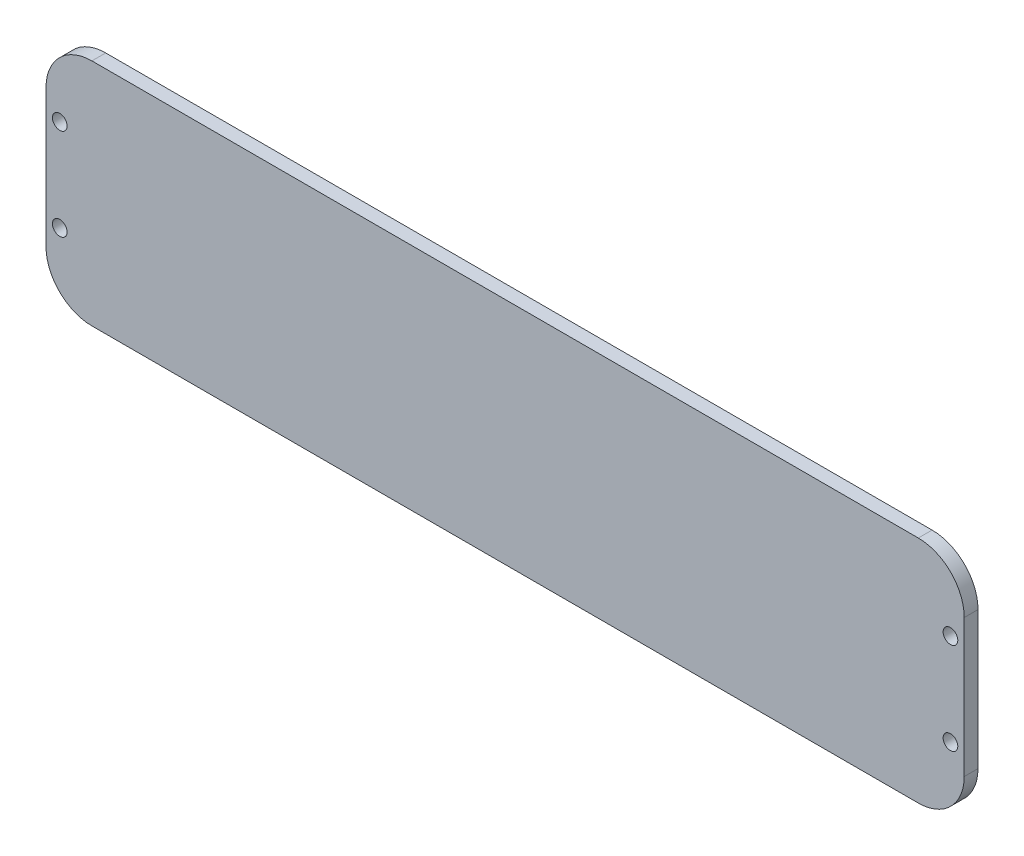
from build123d import *

# Parameters (mm, degrees)
SKETCH_1_W      = 200
SKETCH_1_H      = 50
SKETCH_1_R      = 1.6
EXTRUDE_1_DEPTH = 3
FILLET_1_R      = 10


with BuildPart() as part:
    # Sketch 1 → Extrude 1 (new body)
    with BuildSketch(Plane.XY):
        Rectangle(SKETCH_1_W, SKETCH_1_H)
        with Locations((-97, 10)):
            Circle(SKETCH_1_R, mode=Mode.SUBTRACT)
        with Locations((-97, -10)):
            Circle(SKETCH_1_R, mode=Mode.SUBTRACT)
        with Locations(Location((97, -10, 0), (0, 0, 180))):
            Circle(SKETCH_1_R, mode=Mode.SUBTRACT)
        with Locations(Location((97, 10, 0), (0, 0, 180))):
            Circle(SKETCH_1_R, mode=Mode.SUBTRACT)
    extrude(amount=EXTRUDE_1_DEPTH)

    # Fillet 1
    fillet_1_edges = [part.edges().sort_by_distance(p)[0] for p in [
        (100, -25, 1.5),
        (-100, -25, 1.5),
        (-100, 25, 1.5),
        (100, 25, 1.5),
    ]]
    fillet(fillet_1_edges, radius=FILLET_1_R)


solid = part.part
